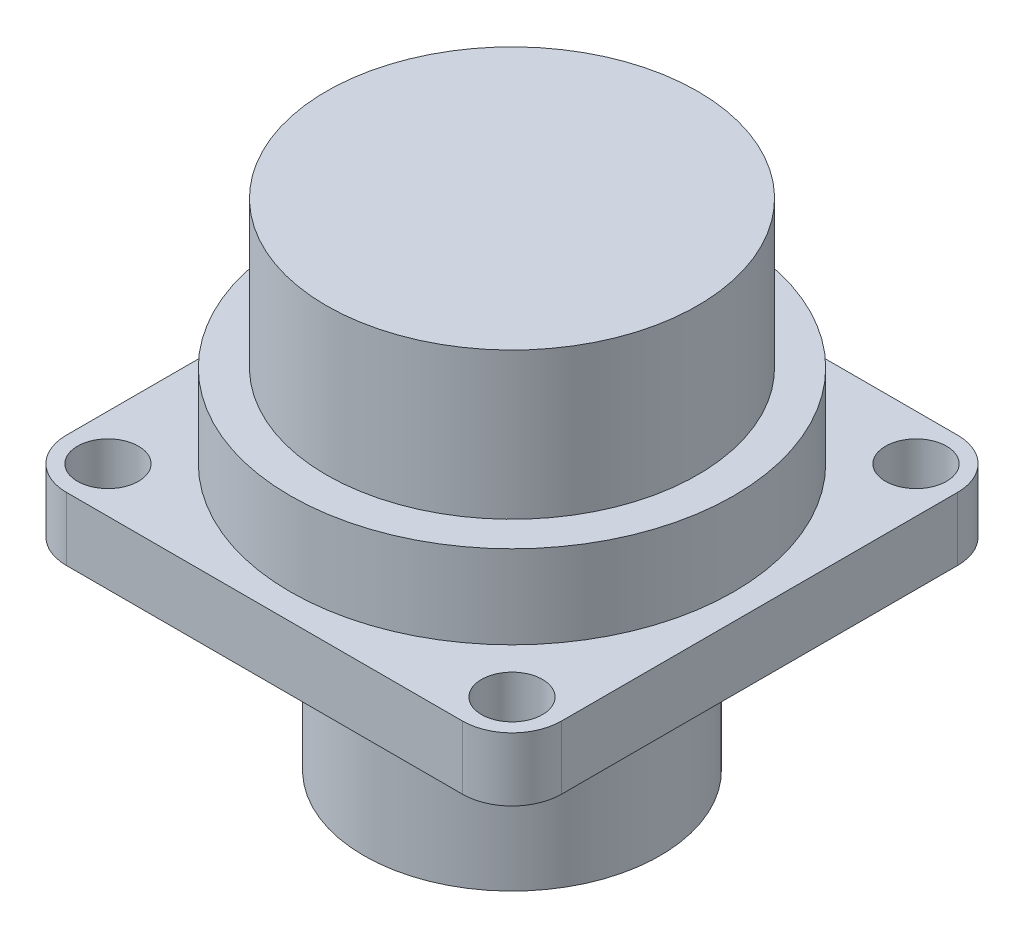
ISO-10303-21;
HEADER;
FILE_DESCRIPTION(('STEP AP214'),'2;1');
FILE_NAME('part.step','',(''),(''),'','','');
FILE_SCHEMA(('AUTOMOTIVE_DESIGN { 1 0 10303 214 1 1 1 1 }'));
ENDSEC;
DATA;
#1=APPLICATION_CONTEXT('core data for automotive mechanical design processes');
#2=APPLICATION_PROTOCOL_DEFINITION('international standard','automotive_design',2000,#1);
#3=PRODUCT_CONTEXT('',#1,'mechanical');
#4=PRODUCT('Part','Part','',(#3));
#5=PRODUCT_RELATED_PRODUCT_CATEGORY('part','',(#4));
#6=PRODUCT_DEFINITION_FORMATION('','',#4);
#7=PRODUCT_DEFINITION_CONTEXT('part definition',#1,'design');
#8=PRODUCT_DEFINITION('design','',#6,#7);
#9=PRODUCT_DEFINITION_SHAPE('','',#8);
#10=(LENGTH_UNIT() NAMED_UNIT(*) SI_UNIT(.MILLI.,.METRE.));
#11=(NAMED_UNIT(*) PLANE_ANGLE_UNIT() SI_UNIT($,.RADIAN.));
#12=(NAMED_UNIT(*) SI_UNIT($,.STERADIAN.) SOLID_ANGLE_UNIT());
#13=UNCERTAINTY_MEASURE_WITH_UNIT(LENGTH_MEASURE(1.E-05),#10,'distance_accuracy_value','');
#14=(GEOMETRIC_REPRESENTATION_CONTEXT(3) GLOBAL_UNCERTAINTY_ASSIGNED_CONTEXT((#13)) GLOBAL_UNIT_ASSIGNED_CONTEXT((#10,
#11,#12)) REPRESENTATION_CONTEXT('',''));
#15=CARTESIAN_POINT('',(0.,0.,0.));
#16=DIRECTION('',(0.,0.,1.));
#17=DIRECTION('',(1.,0.,0.));
#18=AXIS2_PLACEMENT_3D('',#15,#16,#17);
#19=CARTESIAN_POINT('',(-12.7,4.064,-12.7));
#20=DIRECTION('',(0.,-1.,0.));
#21=DIRECTION('',(0.,0.,-1.));
#22=AXIS2_PLACEMENT_3D('',#19,#20,#21);
#23=PLANE('',#22);
#24=CARTESIAN_POINT('',(12.954,4.064,-12.954));
#25=DIRECTION('',(0.,1.,0.));
#26=DIRECTION('',(0.,0.,-1.));
#27=AXIS2_PLACEMENT_3D('',#24,#25,#26);
#28=CIRCLE('',#27,1.9558);
#29=CARTESIAN_POINT('',(12.954,4.064,-14.9098));
#30=VERTEX_POINT('',#29);
#31=EDGE_CURVE('E267',#30,#30,#28,.T.);
#32=ORIENTED_EDGE('',*,*,#31,.F.);
#33=EDGE_LOOP('',(#32));
#34=FACE_BOUND('',#33,.T.);
#35=CARTESIAN_POINT('',(-12.954,4.064,12.954));
#36=DIRECTION('',(0.,1.,0.));
#37=DIRECTION('',(0.,0.,-1.));
#38=AXIS2_PLACEMENT_3D('',#35,#36,#37);
#39=CIRCLE('',#38,1.9558);
#40=CARTESIAN_POINT('',(-12.954,4.064,10.9982));
#41=VERTEX_POINT('',#40);
#42=EDGE_CURVE('E279',#41,#41,#39,.T.);
#43=ORIENTED_EDGE('',*,*,#42,.F.);
#44=EDGE_LOOP('',(#43));
#45=FACE_BOUND('',#44,.T.);
#46=CARTESIAN_POINT('',(-12.7,4.064,-12.7));
#47=DIRECTION('',(0.,1.,0.));
#48=DIRECTION('',(0.,0.,-1.));
#49=AXIS2_PLACEMENT_3D('',#46,#47,#48);
#50=CIRCLE('',#49,3.175);
#51=CARTESIAN_POINT('',(-12.7,4.064,-15.875));
#52=VERTEX_POINT('',#51);
#53=CARTESIAN_POINT('',(-15.875,4.064,-12.7));
#54=VERTEX_POINT('',#53);
#55=EDGE_CURVE('E139',#52,#54,#50,.T.);
#56=ORIENTED_EDGE('',*,*,#55,.T.);
#57=DIRECTION('',(0.,0.,1.));
#58=VECTOR('',#57,1.);
#59=CARTESIAN_POINT('',(-15.875,4.064,-12.7));
#60=LINE('',#59,#58);
#61=CARTESIAN_POINT('',(-15.875,4.064,12.7));
#62=VERTEX_POINT('',#61);
#63=EDGE_CURVE('E114',#54,#62,#60,.T.);
#64=ORIENTED_EDGE('',*,*,#63,.T.);
#65=CARTESIAN_POINT('',(-12.7,4.064,12.7));
#66=DIRECTION('',(0.,1.,0.));
#67=DIRECTION('',(0.,0.,1.));
#68=AXIS2_PLACEMENT_3D('',#65,#66,#67);
#69=CIRCLE('',#68,3.175);
#70=CARTESIAN_POINT('',(-12.7,4.064,15.875));
#71=VERTEX_POINT('',#70);
#72=EDGE_CURVE('E142',#62,#71,#69,.T.);
#73=ORIENTED_EDGE('',*,*,#72,.T.);
#74=DIRECTION('',(1.,0.,0.));
#75=VECTOR('',#74,1.);
#76=CARTESIAN_POINT('',(12.7,4.064,15.875));
#77=LINE('',#76,#75);
#78=CARTESIAN_POINT('',(12.7,4.064,15.875));
#79=VERTEX_POINT('',#78);
#80=EDGE_CURVE('E144',#71,#79,#77,.T.);
#81=ORIENTED_EDGE('',*,*,#80,.T.);
#82=CARTESIAN_POINT('',(12.7,4.064,12.7));
#83=DIRECTION('',(0.,1.,0.));
#84=DIRECTION('',(0.,0.,-1.));
#85=AXIS2_PLACEMENT_3D('',#82,#83,#84);
#86=CIRCLE('',#85,3.175);
#87=CARTESIAN_POINT('',(15.875,4.064,12.7));
#88=VERTEX_POINT('',#87);
#89=EDGE_CURVE('E146',#79,#88,#86,.T.);
#90=ORIENTED_EDGE('',*,*,#89,.T.);
#91=DIRECTION('',(0.,0.,-1.));
#92=VECTOR('',#91,1.);
#93=CARTESIAN_POINT('',(15.875,4.064,-12.7));
#94=LINE('',#93,#92);
#95=CARTESIAN_POINT('',(15.875,4.064,-12.7));
#96=VERTEX_POINT('',#95);
#97=EDGE_CURVE('E148',#88,#96,#94,.T.);
#98=ORIENTED_EDGE('',*,*,#97,.T.);
#99=CARTESIAN_POINT('',(12.7,4.064,-12.7));
#100=DIRECTION('',(0.,1.,0.));
#101=DIRECTION('',(0.,0.,1.));
#102=AXIS2_PLACEMENT_3D('',#99,#100,#101);
#103=CIRCLE('',#102,3.175);
#104=CARTESIAN_POINT('',(12.7,4.064,-15.875));
#105=VERTEX_POINT('',#104);
#106=EDGE_CURVE('E54',#96,#105,#103,.T.);
#107=ORIENTED_EDGE('',*,*,#106,.T.);
#108=DIRECTION('',(-1.,0.,0.));
#109=VECTOR('',#108,1.);
#110=CARTESIAN_POINT('',(12.7,4.064,-15.875));
#111=LINE('',#110,#109);
#112=EDGE_CURVE('E49',#105,#52,#111,.T.);
#113=ORIENTED_EDGE('',*,*,#112,.T.);
#114=EDGE_LOOP('',(#56,#64,#73,#81,#90,#98,#107,#113));
#115=FACE_BOUND('',#114,.T.);
#116=CARTESIAN_POINT('',(-12.954,4.064,-12.954));
#117=DIRECTION('',(0.,1.,0.));
#118=DIRECTION('',(0.,0.,1.));
#119=AXIS2_PLACEMENT_3D('',#116,#117,#118);
#120=CIRCLE('',#119,1.9558);
#121=CARTESIAN_POINT('',(-12.954,4.064,-10.9982));
#122=VERTEX_POINT('',#121);
#123=EDGE_CURVE('E121',#122,#122,#120,.T.);
#124=ORIENTED_EDGE('',*,*,#123,.F.);
#125=EDGE_LOOP('',(#124));
#126=FACE_BOUND('',#125,.T.);
#127=CARTESIAN_POINT('',(12.954,4.064,12.954));
#128=DIRECTION('',(0.,1.,0.));
#129=DIRECTION('',(0.,0.,1.));
#130=AXIS2_PLACEMENT_3D('',#127,#128,#129);
#131=CIRCLE('',#130,1.9558);
#132=CARTESIAN_POINT('',(12.954,4.064,14.9098));
#133=VERTEX_POINT('',#132);
#134=EDGE_CURVE('E273',#133,#133,#131,.T.);
#135=ORIENTED_EDGE('',*,*,#134,.F.);
#136=EDGE_LOOP('',(#135));
#137=FACE_BOUND('',#136,.T.);
#138=CARTESIAN_POINT('',(0.,4.064,0.));
#139=DIRECTION('',(0.,1.,0.));
#140=DIRECTION('',(0.,0.,1.));
#141=AXIS2_PLACEMENT_3D('',#138,#139,#140);
#142=CIRCLE('',#141,14.224);
#143=CARTESIAN_POINT('',(0.,4.064,14.224));
#144=VERTEX_POINT('',#143);
#145=EDGE_CURVE('E117',#144,#144,#142,.T.);
#146=ORIENTED_EDGE('',*,*,#145,.F.);
#147=EDGE_LOOP('',(#146));
#148=FACE_BOUND('',#147,.T.);
#149=ADVANCED_FACE('F32',(#34,#45,#115,#126,#137,#148),#23,.F.);
#150=CARTESIAN_POINT('',(-12.7,0.,-12.7));
#151=DIRECTION('',(0.,-1.,0.));
#152=DIRECTION('',(0.,0.,-1.));
#153=AXIS2_PLACEMENT_3D('',#150,#151,#152);
#154=PLANE('',#153);
#155=CARTESIAN_POINT('',(0.,0.,0.));
#156=DIRECTION('',(0.,-1.,0.));
#157=DIRECTION('',(0.,0.,-1.));
#158=AXIS2_PLACEMENT_3D('',#155,#156,#157);
#159=CIRCLE('',#158,9.4996);
#160=CARTESIAN_POINT('',(0.,0.,-9.4996));
#161=VERTEX_POINT('',#160);
#162=EDGE_CURVE('E11',#161,#161,#159,.T.);
#163=ORIENTED_EDGE('',*,*,#162,.F.);
#164=EDGE_LOOP('',(#163));
#165=FACE_BOUND('',#164,.T.);
#166=CARTESIAN_POINT('',(12.954,0.,12.954));
#167=DIRECTION('',(0.,1.,0.));
#168=DIRECTION('',(0.,0.,1.));
#169=AXIS2_PLACEMENT_3D('',#166,#167,#168);
#170=CIRCLE('',#169,1.9558);
#171=CARTESIAN_POINT('',(12.954,0.,14.9098));
#172=VERTEX_POINT('',#171);
#173=EDGE_CURVE('E270',#172,#172,#170,.T.);
#174=ORIENTED_EDGE('',*,*,#173,.T.);
#175=EDGE_LOOP('',(#174));
#176=FACE_BOUND('',#175,.T.);
#177=CARTESIAN_POINT('',(-12.954,0.,-12.954));
#178=DIRECTION('',(0.,1.,0.));
#179=DIRECTION('',(0.,0.,1.));
#180=AXIS2_PLACEMENT_3D('',#177,#178,#179);
#181=CIRCLE('',#180,1.9558);
#182=CARTESIAN_POINT('',(-12.954,0.,-10.9982));
#183=VERTEX_POINT('',#182);
#184=EDGE_CURVE('E124',#183,#183,#181,.T.);
#185=ORIENTED_EDGE('',*,*,#184,.T.);
#186=EDGE_LOOP('',(#185));
#187=FACE_BOUND('',#186,.T.);
#188=CARTESIAN_POINT('',(-12.7,0.,-12.7));
#189=DIRECTION('',(0.,1.,0.));
#190=DIRECTION('',(0.,0.,-1.));
#191=AXIS2_PLACEMENT_3D('',#188,#189,#190);
#192=CIRCLE('',#191,3.175);
#193=CARTESIAN_POINT('',(-12.7,0.,-15.875));
#194=VERTEX_POINT('',#193);
#195=CARTESIAN_POINT('',(-15.875,0.,-12.7));
#196=VERTEX_POINT('',#195);
#197=EDGE_CURVE('E105',#194,#196,#192,.T.);
#198=ORIENTED_EDGE('',*,*,#197,.F.);
#199=DIRECTION('',(-1.,0.,0.));
#200=VECTOR('',#199,1.);
#201=CARTESIAN_POINT('',(12.7,0.,-15.875));
#202=LINE('',#201,#200);
#203=CARTESIAN_POINT('',(12.7,0.,-15.875));
#204=VERTEX_POINT('',#203);
#205=EDGE_CURVE('E137',#204,#194,#202,.T.);
#206=ORIENTED_EDGE('',*,*,#205,.F.);
#207=CARTESIAN_POINT('',(12.7,0.,-12.7));
#208=DIRECTION('',(0.,1.,0.));
#209=DIRECTION('',(0.,0.,1.));
#210=AXIS2_PLACEMENT_3D('',#207,#208,#209);
#211=CIRCLE('',#210,3.175);
#212=CARTESIAN_POINT('',(15.875,0.,-12.7));
#213=VERTEX_POINT('',#212);
#214=EDGE_CURVE('E135',#213,#204,#211,.T.);
#215=ORIENTED_EDGE('',*,*,#214,.F.);
#216=DIRECTION('',(0.,0.,-1.));
#217=VECTOR('',#216,1.);
#218=CARTESIAN_POINT('',(15.875,0.,-12.7));
#219=LINE('',#218,#217);
#220=CARTESIAN_POINT('',(15.875,0.,12.7));
#221=VERTEX_POINT('',#220);
#222=EDGE_CURVE('E133',#221,#213,#219,.T.);
#223=ORIENTED_EDGE('',*,*,#222,.F.);
#224=CARTESIAN_POINT('',(12.7,0.,12.7));
#225=DIRECTION('',(0.,1.,0.));
#226=DIRECTION('',(0.,0.,-1.));
#227=AXIS2_PLACEMENT_3D('',#224,#225,#226);
#228=CIRCLE('',#227,3.175);
#229=CARTESIAN_POINT('',(12.7,0.,15.875));
#230=VERTEX_POINT('',#229);
#231=EDGE_CURVE('E131',#230,#221,#228,.T.);
#232=ORIENTED_EDGE('',*,*,#231,.F.);
#233=DIRECTION('',(1.,0.,0.));
#234=VECTOR('',#233,1.);
#235=CARTESIAN_POINT('',(12.7,0.,15.875));
#236=LINE('',#235,#234);
#237=CARTESIAN_POINT('',(-12.7,0.,15.875));
#238=VERTEX_POINT('',#237);
#239=EDGE_CURVE('E129',#238,#230,#236,.T.);
#240=ORIENTED_EDGE('',*,*,#239,.F.);
#241=CARTESIAN_POINT('',(-12.7,0.,12.7));
#242=DIRECTION('',(0.,1.,0.));
#243=DIRECTION('',(0.,0.,1.));
#244=AXIS2_PLACEMENT_3D('',#241,#242,#243);
#245=CIRCLE('',#244,3.175);
#246=CARTESIAN_POINT('',(-15.875,0.,12.7));
#247=VERTEX_POINT('',#246);
#248=EDGE_CURVE('E107',#247,#238,#245,.T.);
#249=ORIENTED_EDGE('',*,*,#248,.F.);
#250=DIRECTION('',(0.,0.,1.));
#251=VECTOR('',#250,1.);
#252=CARTESIAN_POINT('',(-15.875,0.,-12.7));
#253=LINE('',#252,#251);
#254=EDGE_CURVE('E99',#196,#247,#253,.T.);
#255=ORIENTED_EDGE('',*,*,#254,.F.);
#256=EDGE_LOOP('',(#198,#206,#215,#223,#232,#240,#249,#255));
#257=FACE_BOUND('',#256,.T.);
#258=CARTESIAN_POINT('',(-12.954,0.,12.954));
#259=DIRECTION('',(0.,1.,0.));
#260=DIRECTION('',(0.,0.,-1.));
#261=AXIS2_PLACEMENT_3D('',#258,#259,#260);
#262=CIRCLE('',#261,1.9558);
#263=CARTESIAN_POINT('',(-12.954,0.,10.9982));
#264=VERTEX_POINT('',#263);
#265=EDGE_CURVE('E276',#264,#264,#262,.T.);
#266=ORIENTED_EDGE('',*,*,#265,.T.);
#267=EDGE_LOOP('',(#266));
#268=FACE_BOUND('',#267,.T.);
#269=CARTESIAN_POINT('',(12.954,0.,-12.954));
#270=DIRECTION('',(0.,1.,0.));
#271=DIRECTION('',(0.,0.,-1.));
#272=AXIS2_PLACEMENT_3D('',#269,#270,#271);
#273=CIRCLE('',#272,1.9558);
#274=CARTESIAN_POINT('',(12.954,0.,-14.9098));
#275=VERTEX_POINT('',#274);
#276=EDGE_CURVE('E264',#275,#275,#273,.T.);
#277=ORIENTED_EDGE('',*,*,#276,.T.);
#278=EDGE_LOOP('',(#277));
#279=FACE_BOUND('',#278,.T.);
#280=ADVANCED_FACE('F101',(#165,#176,#187,#257,#268,#279),#154,.T.);
#281=CARTESIAN_POINT('',(-12.7,4.064,-12.7));
#282=DIRECTION('',(0.,-1.,0.));
#283=DIRECTION('',(0.,0.,-1.));
#284=AXIS2_PLACEMENT_3D('',#281,#282,#283);
#285=CYLINDRICAL_SURFACE('',#284,3.175);
#286=ORIENTED_EDGE('',*,*,#197,.T.);
#287=DIRECTION('',(0.,-1.,0.));
#288=VECTOR('',#287,1.);
#289=CARTESIAN_POINT('',(-15.875,4.064,-12.7));
#290=LINE('',#289,#288);
#291=EDGE_CURVE('E36',#54,#196,#290,.T.);
#292=ORIENTED_EDGE('',*,*,#291,.F.);
#293=ORIENTED_EDGE('',*,*,#55,.F.);
#294=DIRECTION('',(0.,-1.,0.));
#295=VECTOR('',#294,1.);
#296=CARTESIAN_POINT('',(-12.7,4.064,-15.875));
#297=LINE('',#296,#295);
#298=EDGE_CURVE('E120',#52,#194,#297,.T.);
#299=ORIENTED_EDGE('',*,*,#298,.T.);
#300=EDGE_LOOP('',(#286,#292,#293,#299));
#301=FACE_BOUND('',#300,.T.);
#302=ADVANCED_FACE('F34',(#301),#285,.T.);
#303=CARTESIAN_POINT('',(-15.875,4.064,-12.7));
#304=DIRECTION('',(1.,0.,0.));
#305=DIRECTION('',(0.,0.,-1.));
#306=AXIS2_PLACEMENT_3D('',#303,#304,#305);
#307=PLANE('',#306);
#308=ORIENTED_EDGE('',*,*,#254,.T.);
#309=DIRECTION('',(0.,-1.,0.));
#310=VECTOR('',#309,1.);
#311=CARTESIAN_POINT('',(-15.875,4.064,12.7));
#312=LINE('',#311,#310);
#313=EDGE_CURVE('E118',#62,#247,#312,.T.);
#314=ORIENTED_EDGE('',*,*,#313,.F.);
#315=ORIENTED_EDGE('',*,*,#63,.F.);
#316=ORIENTED_EDGE('',*,*,#291,.T.);
#317=EDGE_LOOP('',(#308,#314,#315,#316));
#318=FACE_BOUND('',#317,.T.);
#319=ADVANCED_FACE('F113',(#318),#307,.F.);
#320=CARTESIAN_POINT('',(-12.7,4.064,12.7));
#321=DIRECTION('',(0.,-1.,0.));
#322=DIRECTION('',(0.,0.,-1.));
#323=AXIS2_PLACEMENT_3D('',#320,#321,#322);
#324=CYLINDRICAL_SURFACE('',#323,3.175);
#325=ORIENTED_EDGE('',*,*,#248,.T.);
#326=DIRECTION('',(0.,-1.,0.));
#327=VECTOR('',#326,1.);
#328=CARTESIAN_POINT('',(-12.7,4.064,15.875));
#329=LINE('',#328,#327);
#330=EDGE_CURVE('E165',#71,#238,#329,.T.);
#331=ORIENTED_EDGE('',*,*,#330,.F.);
#332=ORIENTED_EDGE('',*,*,#72,.F.);
#333=ORIENTED_EDGE('',*,*,#313,.T.);
#334=EDGE_LOOP('',(#325,#331,#332,#333));
#335=FACE_BOUND('',#334,.T.);
#336=ADVANCED_FACE('F169',(#335),#324,.T.);
#337=CARTESIAN_POINT('',(12.7,4.064,15.875));
#338=DIRECTION('',(0.,0.,-1.));
#339=DIRECTION('',(-1.,0.,0.));
#340=AXIS2_PLACEMENT_3D('',#337,#338,#339);
#341=PLANE('',#340);
#342=ORIENTED_EDGE('',*,*,#239,.T.);
#343=DIRECTION('',(0.,-1.,0.));
#344=VECTOR('',#343,1.);
#345=CARTESIAN_POINT('',(12.7,4.064,15.875));
#346=LINE('',#345,#344);
#347=EDGE_CURVE('E162',#79,#230,#346,.T.);
#348=ORIENTED_EDGE('',*,*,#347,.F.);
#349=ORIENTED_EDGE('',*,*,#80,.F.);
#350=ORIENTED_EDGE('',*,*,#330,.T.);
#351=EDGE_LOOP('',(#342,#348,#349,#350));
#352=FACE_BOUND('',#351,.T.);
#353=ADVANCED_FACE('F177',(#352),#341,.F.);
#354=CARTESIAN_POINT('',(12.7,4.064,12.7));
#355=DIRECTION('',(0.,-1.,0.));
#356=DIRECTION('',(0.,0.,-1.));
#357=AXIS2_PLACEMENT_3D('',#354,#355,#356);
#358=CYLINDRICAL_SURFACE('',#357,3.175);
#359=ORIENTED_EDGE('',*,*,#231,.T.);
#360=DIRECTION('',(0.,-1.,0.));
#361=VECTOR('',#360,1.);
#362=CARTESIAN_POINT('',(15.875,4.064,12.7));
#363=LINE('',#362,#361);
#364=EDGE_CURVE('E159',#88,#221,#363,.T.);
#365=ORIENTED_EDGE('',*,*,#364,.F.);
#366=ORIENTED_EDGE('',*,*,#89,.F.);
#367=ORIENTED_EDGE('',*,*,#347,.T.);
#368=EDGE_LOOP('',(#359,#365,#366,#367));
#369=FACE_BOUND('',#368,.T.);
#370=ADVANCED_FACE('F180',(#369),#358,.T.);
#371=CARTESIAN_POINT('',(15.875,4.064,-12.7));
#372=DIRECTION('',(-1.,0.,0.));
#373=DIRECTION('',(0.,0.,1.));
#374=AXIS2_PLACEMENT_3D('',#371,#372,#373);
#375=PLANE('',#374);
#376=ORIENTED_EDGE('',*,*,#222,.T.);
#377=DIRECTION('',(0.,-1.,0.));
#378=VECTOR('',#377,1.);
#379=CARTESIAN_POINT('',(15.875,4.064,-12.7));
#380=LINE('',#379,#378);
#381=EDGE_CURVE('E156',#96,#213,#380,.T.);
#382=ORIENTED_EDGE('',*,*,#381,.F.);
#383=ORIENTED_EDGE('',*,*,#97,.F.);
#384=ORIENTED_EDGE('',*,*,#364,.T.);
#385=EDGE_LOOP('',(#376,#382,#383,#384));
#386=FACE_BOUND('',#385,.T.);
#387=ADVANCED_FACE('F185',(#386),#375,.F.);
#388=CARTESIAN_POINT('',(12.7,4.064,-12.7));
#389=DIRECTION('',(0.,-1.,0.));
#390=DIRECTION('',(0.,0.,-1.));
#391=AXIS2_PLACEMENT_3D('',#388,#389,#390);
#392=CYLINDRICAL_SURFACE('',#391,3.175);
#393=ORIENTED_EDGE('',*,*,#214,.T.);
#394=DIRECTION('',(0.,-1.,0.));
#395=VECTOR('',#394,1.);
#396=CARTESIAN_POINT('',(12.7,4.064,-15.875));
#397=LINE('',#396,#395);
#398=EDGE_CURVE('E153',#105,#204,#397,.T.);
#399=ORIENTED_EDGE('',*,*,#398,.F.);
#400=ORIENTED_EDGE('',*,*,#106,.F.);
#401=ORIENTED_EDGE('',*,*,#381,.T.);
#402=EDGE_LOOP('',(#393,#399,#400,#401));
#403=FACE_BOUND('',#402,.T.);
#404=ADVANCED_FACE('F188',(#403),#392,.T.);
#405=CARTESIAN_POINT('',(12.7,4.064,-15.875));
#406=DIRECTION('',(0.,0.,1.));
#407=DIRECTION('',(1.,0.,0.));
#408=AXIS2_PLACEMENT_3D('',#405,#406,#407);
#409=PLANE('',#408);
#410=ORIENTED_EDGE('',*,*,#205,.T.);
#411=ORIENTED_EDGE('',*,*,#298,.F.);
#412=ORIENTED_EDGE('',*,*,#112,.F.);
#413=ORIENTED_EDGE('',*,*,#398,.T.);
#414=EDGE_LOOP('',(#410,#411,#412,#413));
#415=FACE_BOUND('',#414,.T.);
#416=ADVANCED_FACE('F190',(#415),#409,.F.);
#417=CARTESIAN_POINT('',(-12.954,4.064,-12.954));
#418=DIRECTION('',(0.,-1.,0.));
#419=DIRECTION('',(0.,0.,-1.));
#420=AXIS2_PLACEMENT_3D('',#417,#418,#419);
#421=CYLINDRICAL_SURFACE('',#420,1.9558);
#422=ORIENTED_EDGE('',*,*,#123,.T.);
#423=EDGE_LOOP('',(#422));
#424=FACE_BOUND('',#423,.T.);
#425=ORIENTED_EDGE('',*,*,#184,.F.);
#426=EDGE_LOOP('',(#425));
#427=FACE_BOUND('',#426,.T.);
#428=ADVANCED_FACE('F192',(#424,#427),#421,.F.);
#429=CARTESIAN_POINT('',(-12.954,4.064,12.954));
#430=DIRECTION('',(0.,-1.,0.));
#431=DIRECTION('',(0.,0.,-1.));
#432=AXIS2_PLACEMENT_3D('',#429,#430,#431);
#433=CYLINDRICAL_SURFACE('',#432,1.9558);
#434=ORIENTED_EDGE('',*,*,#42,.T.);
#435=EDGE_LOOP('',(#434));
#436=FACE_BOUND('',#435,.T.);
#437=ORIENTED_EDGE('',*,*,#265,.F.);
#438=EDGE_LOOP('',(#437));
#439=FACE_BOUND('',#438,.T.);
#440=ADVANCED_FACE('F198',(#436,#439),#433,.F.);
#441=CARTESIAN_POINT('',(12.954,4.064,12.954));
#442=DIRECTION('',(0.,-1.,0.));
#443=DIRECTION('',(0.,0.,-1.));
#444=AXIS2_PLACEMENT_3D('',#441,#442,#443);
#445=CYLINDRICAL_SURFACE('',#444,1.9558);
#446=ORIENTED_EDGE('',*,*,#134,.T.);
#447=EDGE_LOOP('',(#446));
#448=FACE_BOUND('',#447,.T.);
#449=ORIENTED_EDGE('',*,*,#173,.F.);
#450=EDGE_LOOP('',(#449));
#451=FACE_BOUND('',#450,.T.);
#452=ADVANCED_FACE('F215',(#448,#451),#445,.F.);
#453=CARTESIAN_POINT('',(12.954,4.064,-12.954));
#454=DIRECTION('',(0.,-1.,0.));
#455=DIRECTION('',(0.,0.,-1.));
#456=AXIS2_PLACEMENT_3D('',#453,#454,#455);
#457=CYLINDRICAL_SURFACE('',#456,1.9558);
#458=ORIENTED_EDGE('',*,*,#31,.T.);
#459=EDGE_LOOP('',(#458));
#460=FACE_BOUND('',#459,.T.);
#461=ORIENTED_EDGE('',*,*,#276,.F.);
#462=EDGE_LOOP('',(#461));
#463=FACE_BOUND('',#462,.T.);
#464=ADVANCED_FACE('F219',(#460,#463),#457,.F.);
#465=CARTESIAN_POINT('',(0.,9.398,0.));
#466=DIRECTION('',(0.,-1.,0.));
#467=DIRECTION('',(0.,0.,-1.));
#468=AXIS2_PLACEMENT_3D('',#465,#466,#467);
#469=CYLINDRICAL_SURFACE('',#468,14.224);
#470=CARTESIAN_POINT('',(0.,9.398,0.));
#471=DIRECTION('',(0.,1.,0.));
#472=DIRECTION('',(0.,0.,1.));
#473=AXIS2_PLACEMENT_3D('',#470,#471,#472);
#474=CIRCLE('',#473,14.224);
#475=CARTESIAN_POINT('',(0.,9.398,14.224));
#476=VERTEX_POINT('',#475);
#477=EDGE_CURVE('E255',#476,#476,#474,.T.);
#478=ORIENTED_EDGE('',*,*,#477,.F.);
#479=EDGE_LOOP('',(#478));
#480=FACE_BOUND('',#479,.T.);
#481=ORIENTED_EDGE('',*,*,#145,.T.);
#482=EDGE_LOOP('',(#481));
#483=FACE_BOUND('',#482,.T.);
#484=ADVANCED_FACE('F223',(#480,#483),#469,.T.);
#485=CARTESIAN_POINT('',(0.,9.398,0.));
#486=DIRECTION('',(0.,1.,0.));
#487=DIRECTION('',(0.,0.,1.));
#488=AXIS2_PLACEMENT_3D('',#485,#486,#487);
#489=PLANE('',#488);
#490=CARTESIAN_POINT('',(0.,9.398,0.));
#491=DIRECTION('',(0.,1.,0.));
#492=DIRECTION('',(0.,0.,1.));
#493=AXIS2_PLACEMENT_3D('',#490,#491,#492);
#494=CIRCLE('',#493,11.90625);
#495=CARTESIAN_POINT('',(0.,9.398,11.90625));
#496=VERTEX_POINT('',#495);
#497=EDGE_CURVE('E41',#496,#496,#494,.T.);
#498=ORIENTED_EDGE('',*,*,#497,.F.);
#499=EDGE_LOOP('',(#498));
#500=FACE_BOUND('',#499,.T.);
#501=ORIENTED_EDGE('',*,*,#477,.T.);
#502=EDGE_LOOP('',(#501));
#503=FACE_BOUND('',#502,.T.);
#504=ADVANCED_FACE('F227',(#500,#503),#489,.T.);
#505=CARTESIAN_POINT('',(0.,18.796,0.));
#506=DIRECTION('',(0.,-1.,0.));
#507=DIRECTION('',(0.,0.,-1.));
#508=AXIS2_PLACEMENT_3D('',#505,#506,#507);
#509=CYLINDRICAL_SURFACE('',#508,11.90625);
#510=CARTESIAN_POINT('',(0.,18.796,0.));
#511=DIRECTION('',(0.,1.,0.));
#512=DIRECTION('',(0.,0.,1.));
#513=AXIS2_PLACEMENT_3D('',#510,#511,#512);
#514=CIRCLE('',#513,11.90625);
#515=CARTESIAN_POINT('',(0.,18.796,11.90625));
#516=VERTEX_POINT('',#515);
#517=EDGE_CURVE('E252',#516,#516,#514,.T.);
#518=ORIENTED_EDGE('',*,*,#517,.F.);
#519=EDGE_LOOP('',(#518));
#520=FACE_BOUND('',#519,.T.);
#521=ORIENTED_EDGE('',*,*,#497,.T.);
#522=EDGE_LOOP('',(#521));
#523=FACE_BOUND('',#522,.T.);
#524=ADVANCED_FACE('F231',(#520,#523),#509,.T.);
#525=CARTESIAN_POINT('',(0.,18.796,0.));
#526=DIRECTION('',(0.,1.,0.));
#527=DIRECTION('',(0.,0.,1.));
#528=AXIS2_PLACEMENT_3D('',#525,#526,#527);
#529=PLANE('',#528);
#530=ORIENTED_EDGE('',*,*,#517,.T.);
#531=EDGE_LOOP('',(#530));
#532=FACE_BOUND('',#531,.T.);
#533=ADVANCED_FACE('F235',(#532),#529,.T.);
#534=CARTESIAN_POINT('',(0.,-12.954,0.));
#535=DIRECTION('',(0.,1.,0.));
#536=DIRECTION('',(0.,0.,1.));
#537=AXIS2_PLACEMENT_3D('',#534,#535,#536);
#538=CYLINDRICAL_SURFACE('',#537,9.4996);
#539=CARTESIAN_POINT('',(0.,-12.954,0.));
#540=DIRECTION('',(0.,-1.,0.));
#541=DIRECTION('',(0.,0.,-1.));
#542=AXIS2_PLACEMENT_3D('',#539,#540,#541);
#543=CIRCLE('',#542,9.4996);
#544=CARTESIAN_POINT('',(0.,-12.954,-9.4996));
#545=VERTEX_POINT('',#544);
#546=EDGE_CURVE('E251',#545,#545,#543,.T.);
#547=ORIENTED_EDGE('',*,*,#546,.F.);
#548=EDGE_LOOP('',(#547));
#549=FACE_BOUND('',#548,.T.);
#550=ORIENTED_EDGE('',*,*,#162,.T.);
#551=EDGE_LOOP('',(#550));
#552=FACE_BOUND('',#551,.T.);
#553=ADVANCED_FACE('F239',(#549,#552),#538,.T.);
#554=CARTESIAN_POINT('',(0.,-12.954,0.));
#555=DIRECTION('',(0.,-1.,0.));
#556=DIRECTION('',(0.,0.,-1.));
#557=AXIS2_PLACEMENT_3D('',#554,#555,#556);
#558=PLANE('',#557);
#559=ORIENTED_EDGE('',*,*,#546,.T.);
#560=EDGE_LOOP('',(#559));
#561=FACE_BOUND('',#560,.T.);
#562=ADVANCED_FACE('F243',(#561),#558,.T.);
#563=CLOSED_SHELL('',(#149,#280,#302,#319,#336,#353,#370,#387,#404,#416,#428,#440,#452,#464,
#484,#504,#524,#533,#553,#562));
#564=MANIFOLD_SOLID_BREP('B2',#563);
#565=ADVANCED_BREP_SHAPE_REPRESENTATION('',(#18,#564),#14);
#566=SHAPE_DEFINITION_REPRESENTATION(#9,#565);
ENDSEC;
END-ISO-10303-21;
